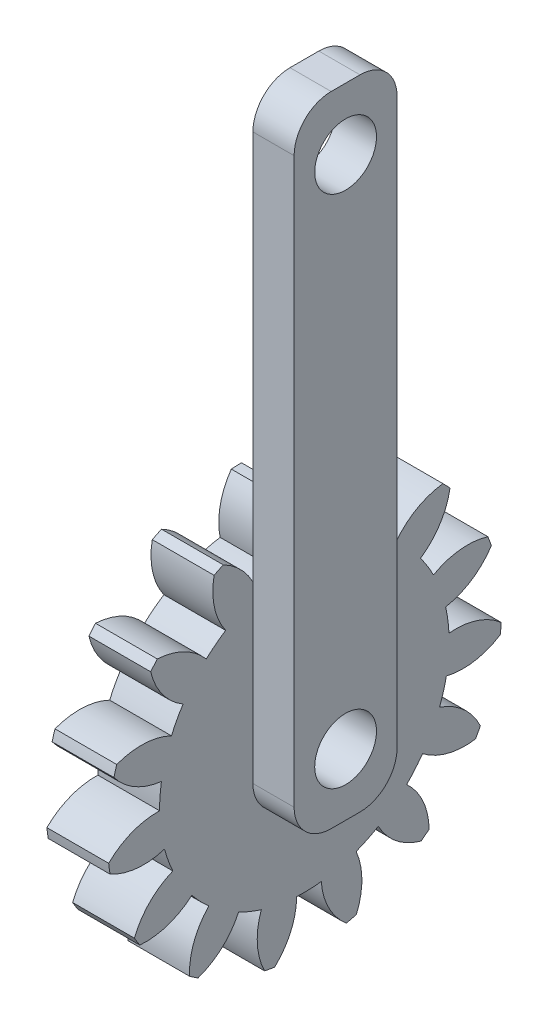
from build123d import *
from build123d.topology import SkipClean

# Parameters (mm, degrees)
SKETCH1_W           = 5
SKETCH1_H           = 31
SKETCH1_R           = 1.5
BOSS_EXTRUDE1_DEPTH = 2
FILLET1_R           = 1.8
BOSS_EXTRUDE2_START = 3
SKETCH5_R           = 1.5
BOSS_EXTRUDE2_DEPTH = 3


with BuildPart() as part:
    # Sketch1 → Boss-Extrude1 (new body)
    with BuildSketch(Plane(origin=(0, 0, 0), x_dir=(0, 0, -1), z_dir=(1, 0, 0))):
        with Locations((0, 15.5)):
            Rectangle(SKETCH1_W, SKETCH1_H)
        with Locations((0, 28)):
            Circle(SKETCH1_R, mode=Mode.SUBTRACT)
        with Locations((0, 3)):
            Circle(SKETCH1_R, mode=Mode.SUBTRACT)
    extrude(amount=BOSS_EXTRUDE1_DEPTH)

    # Fillet1
    fillet1_edges = [part.edges().sort_by_distance(p)[0] for p in [
        (1, 31, 2.5),
        (1, 31, -2.5),
        (1, 0, -2.5),
        (1, 0, 2.5),
    ]]
    fillet(fillet1_edges, radius=FILLET1_R)

    # Sketch5 → Boss-Extrude2 (add)
    with SkipClean():  # the faces are left unmerged after this step: merging them gives an invalid solid
        with BuildSketch(Plane.ZY.offset(BOSS_EXTRUDE2_START)):
            with BuildLine():
                ThreePointArc((-6.267194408, 6.185386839), (-7.558625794, 6.600595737), (-8.909222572, 6.473781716))
                ThreePointArc((-8.909222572, 6.473781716), (-8.996415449, 6.241282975), (-9.077542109, 6.006598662))
                ThreePointArc((-9.077542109, 6.006598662), (-8.118171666, 5.047535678), (-6.858677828, 4.543681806))
                ThreePointArc((-6.858677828, 4.543681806), (-6.964981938, 3.95574142), (-7.020980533, 3.360898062))
                ThreePointArc((-7.020980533, 3.360898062), (-8.369642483, 3.214937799), (-9.551894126, 2.549750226))
                ThreePointArc((-9.551894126, 2.549750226), (-9.536983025, 2.30188752), (-9.515641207, 2.054495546))
                ThreePointArc((-9.515641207, 2.054495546), (-8.249126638, 1.568559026), (-6.893585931, 1.620547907))
                ThreePointArc((-6.893585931, 1.620547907), (-6.751562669, 1.04019986), (-6.560775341, 0.474006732))
                ThreePointArc((-6.560775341, 0.474006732), (-7.733471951, -0.207884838), (-8.542956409, -1.296428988))
                ThreePointArc((-8.542956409, -1.296428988), (-8.428519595, -1.516797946), (-8.308399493, -1.73412126))
                ThreePointArc((-8.308399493, -1.73412126), (-6.953732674, -1.662908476), (-5.7365304, -1.064066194))
                ThreePointArc((-5.7365304, -1.064066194), (-5.370736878, -1.536474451), (-4.966152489, -1.976117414))
                ThreePointArc((-4.966152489, -1.976117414), (-5.760113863, -3.076035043), (-6.056863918, -4.399716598))
                ThreePointArc((-6.056863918, -4.399716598), (-5.862688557, -4.554488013), (-5.664560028, -4.704165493))
                ThreePointArc((-5.664560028, -4.704165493), (-4.455975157, -4.088116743), (-3.587576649, -3.045966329))
                ThreePointArc((-3.587576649, -3.045966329), (-3.061261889, -3.328751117), (-2.512836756, -3.565825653))
                ThreePointArc((-2.512836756, -3.565825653), (-2.790779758, -4.89358359), (-2.523484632, -6.223525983))
                ThreePointArc((-2.523484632, -6.223525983), (-2.283145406, -6.285938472), (-2.041266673, -6.342089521))
                ThreePointArc((-2.041266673, -6.342089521), (-1.187739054, -5.28772523), (-0.818298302, -3.98246396))
                ThreePointArc((-0.818298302, -3.98246396), (-0.222466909, -4.02672922), (0.374971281, -4.020242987))
                ThreePointArc((0.374971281, -4.020242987), (0.66110552, -5.346259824), (1.446228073, -6.452503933))
                ThreePointArc((1.446228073, -6.452503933), (1.691174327, -6.411765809), (1.934980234, -6.364681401))
                ThreePointArc((1.934980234, -6.364681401), (2.285867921, -5.054310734), (2.092471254, -3.711630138))
                ThreePointArc((2.092471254, -3.711630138), (2.65479462, -3.509722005), (3.197943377, -3.260796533))
                ThreePointArc((3.197943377, -3.260796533), (3.998679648, -4.35579191), (5.165874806, -5.04705808))
                ThreePointArc((5.165874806, -5.04705808), (5.373074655, -4.910213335), (5.57665148, -4.768034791))
                ThreePointArc((5.57665148, -4.768034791), (5.364227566, -3.428232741), (4.641433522, -2.280294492))
                ThreePointArc((4.641433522, -2.280294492), (5.073018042, -1.867124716), (5.46796201, -1.41880148))
                ThreePointArc((5.46796201, -1.41880148), (6.644845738, -2.09344075), (7.992294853, -2.250202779))
                ThreePointArc((7.992294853, -2.250202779), (8.125921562, -2.040913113), (8.254069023, -1.828224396))
                ThreePointArc((8.254069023, -1.828224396), (7.515063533, -0.690654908), (6.387849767, 0.064052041))
                ThreePointArc((6.387849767, 0.064052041), (6.614070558, 0.617042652), (6.792520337, 1.187244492))
                ThreePointArc((6.792520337, 1.187244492), (8.142057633, 1.049612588), (9.436774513, 1.454460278))
                ThreePointArc((9.436774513, 1.454460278), (9.47372281, 1.700006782), (9.504283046, 1.946429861))
                ThreePointArc((9.504283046, 1.946429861), (8.366476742, 2.685070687), (7.029748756, 2.916050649))
                ThreePointArc((7.029748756, 2.916050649), (7.011490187, 3.513244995), (6.94259019, 4.10673236))
                ThreePointArc((6.94259019, 4.10673236), (8.231433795, 4.529905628), (9.24955013, 5.426361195))
                ThreePointArc((9.24955013, 5.426361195), (9.183431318, 5.665707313), (9.111120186, 5.903255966))
                ThreePointArc((9.111120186, 5.903255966), (7.771250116, 6.115250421), (6.456140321, 5.782564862))
                ThreePointArc((6.456140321, 5.782564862), (6.196559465, 6.320702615), (5.892223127, 6.834856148))
                ThreePointArc((5.892223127, 6.834856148), (6.897520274, 7.745664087), (7.462994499, 8.978722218))
                ThreePointArc((7.462994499, 8.978722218), (7.305241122, 9.170482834), (7.142561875, 9.358082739))
                ThreePointArc((7.142561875, 9.358082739), (5.832303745, 9.006775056), (4.766206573, 8.167948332))
                ThreePointArc((4.766206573, 8.167948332), (4.310187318, 8.553980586), (3.823037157, 8.89989847))
                ThreePointArc((3.823037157, 8.89989847), (4.370962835, 10.140854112), (4.38601932, 11.497307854))
                ThreePointArc((4.38601932, 11.497307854), (4.16390837, 11.608325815), (3.938989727, 11.713539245))
                ThreePointArc((3.938989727, 11.713539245), (2.884899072, 10.859673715), (2.252152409, 9.659746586))
                ThreePointArc((2.252152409, 9.659746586), (1.678544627, 9.826924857), (1.092813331, 9.944794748))
                ThreePointArc((1.092813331, 9.944794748), (1.088626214, 11.301325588), (0.550661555, 12.546631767))
                ThreePointArc((0.550661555, 12.546631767), (0.302598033, 12.557711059), (0.054330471, 12.562345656))
                ThreePointArc((0.054330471, 12.562345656), (-0.561330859, 11.353563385), (-0.651319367, 10.000014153))
                ThreePointArc((-0.651319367, 10.000014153), (-1.24333368, 9.919431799), (-1.826367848, 9.788872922))
                ThreePointArc((-1.826367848, 9.788872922), (-2.38194377, 11.026422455), (-3.379910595, 11.945256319))
                ThreePointArc((-3.379910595, 11.945256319), (-3.611034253, 11.854481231), (-3.839723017, 11.757735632))
                ThreePointArc((-3.839723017, 11.757735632), (-3.910501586, 10.403046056), (-3.442172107, 9.12991568))
                ThreePointArc((-3.442172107, 9.12991568), (-3.950228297, 8.815506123), (-4.429753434, 8.459093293))
                ThreePointArc((-4.429753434, 8.459093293), (-5.440654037, 9.363677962), (-6.726065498, 9.797164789))
                ThreePointArc((-6.726065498, 9.797164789), (-6.900285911, 9.620231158), (-7.069853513, 9.438833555))
                ThreePointArc((-7.069853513, 9.438833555), (-6.583511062, 8.172474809), (-5.637842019, 7.199899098))
                ThreePointArc((-5.637842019, 7.199899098), (-5.974092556, 6.706026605), (-6.267194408, 6.185386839))
            make_face()
            with Locations((0, 3)):
                Circle(SKETCH5_R, mode=Mode.SUBTRACT)
        extrude(amount=-BOSS_EXTRUDE2_DEPTH)


solid = part.part
